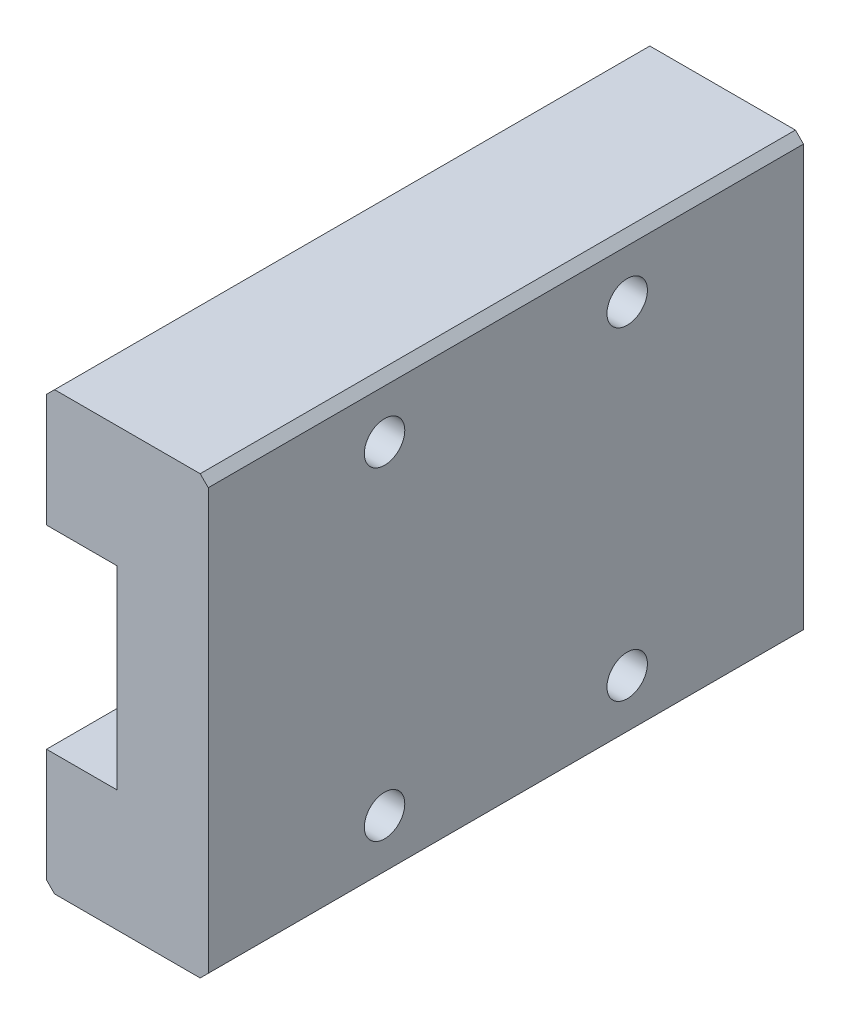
ISO-10303-21;
HEADER;
FILE_DESCRIPTION(('STEP AP214'),'2;1');
FILE_NAME('part.step','',(''),(''),'','','');
FILE_SCHEMA(('AUTOMOTIVE_DESIGN { 1 0 10303 214 1 1 1 1 }'));
ENDSEC;
DATA;
#1=APPLICATION_CONTEXT('core data for automotive mechanical design processes');
#2=APPLICATION_PROTOCOL_DEFINITION('international standard','automotive_design',2000,#1);
#3=PRODUCT_CONTEXT('',#1,'mechanical');
#4=PRODUCT('Part','Part','',(#3));
#5=PRODUCT_RELATED_PRODUCT_CATEGORY('part','',(#4));
#6=PRODUCT_DEFINITION_FORMATION('','',#4);
#7=PRODUCT_DEFINITION_CONTEXT('part definition',#1,'design');
#8=PRODUCT_DEFINITION('design','',#6,#7);
#9=PRODUCT_DEFINITION_SHAPE('','',#8);
#10=(LENGTH_UNIT() NAMED_UNIT(*) SI_UNIT(.MILLI.,.METRE.));
#11=(NAMED_UNIT(*) PLANE_ANGLE_UNIT() SI_UNIT($,.RADIAN.));
#12=(NAMED_UNIT(*) SI_UNIT($,.STERADIAN.) SOLID_ANGLE_UNIT());
#13=UNCERTAINTY_MEASURE_WITH_UNIT(LENGTH_MEASURE(1.E-05),#10,'distance_accuracy_value','');
#14=(GEOMETRIC_REPRESENTATION_CONTEXT(3) GLOBAL_UNCERTAINTY_ASSIGNED_CONTEXT((#13)) GLOBAL_UNIT_ASSIGNED_CONTEXT((#10,
#11,#12)) REPRESENTATION_CONTEXT('',''));
#15=CARTESIAN_POINT('',(0.,0.,0.));
#16=DIRECTION('',(0.,0.,1.));
#17=DIRECTION('',(1.,0.,0.));
#18=AXIS2_PLACEMENT_3D('',#15,#16,#17);
#19=CARTESIAN_POINT('',(0.500000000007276,0.,36.8));
#20=DIRECTION('',(0.,1.,0.));
#21=DIRECTION('',(0.,0.,1.));
#22=AXIS2_PLACEMENT_3D('',#19,#20,#21);
#23=PLANE('',#22);
#24=DIRECTION('',(1.,0.,0.));
#25=VECTOR('',#24,1.);
#26=CARTESIAN_POINT('',(0.500000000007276,0.,0.));
#27=LINE('',#26,#25);
#28=CARTESIAN_POINT('',(0.500000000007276,0.,0.));
#29=VERTEX_POINT('',#28);
#30=CARTESIAN_POINT('',(9.50000000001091,0.,0.));
#31=VERTEX_POINT('',#30);
#32=EDGE_CURVE('E154',#29,#31,#27,.T.);
#33=ORIENTED_EDGE('',*,*,#32,.T.);
#34=DIRECTION('',(0.,0.,-1.));
#35=VECTOR('',#34,1.);
#36=CARTESIAN_POINT('',(9.50000000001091,0.,36.8));
#37=LINE('',#36,#35);
#38=CARTESIAN_POINT('',(9.50000000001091,0.,36.8));
#39=VERTEX_POINT('',#38);
#40=EDGE_CURVE('E11',#39,#31,#37,.T.);
#41=ORIENTED_EDGE('',*,*,#40,.F.);
#42=DIRECTION('',(1.,0.,0.));
#43=VECTOR('',#42,1.);
#44=CARTESIAN_POINT('',(0.500000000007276,0.,36.8));
#45=LINE('',#44,#43);
#46=CARTESIAN_POINT('',(0.500000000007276,0.,36.8));
#47=VERTEX_POINT('',#46);
#48=EDGE_CURVE('E177',#47,#39,#45,.T.);
#49=ORIENTED_EDGE('',*,*,#48,.F.);
#50=DIRECTION('',(0.,0.,-1.));
#51=VECTOR('',#50,1.);
#52=CARTESIAN_POINT('',(0.500000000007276,0.,36.8));
#53=LINE('',#52,#51);
#54=EDGE_CURVE('E150',#47,#29,#53,.T.);
#55=ORIENTED_EDGE('',*,*,#54,.T.);
#56=EDGE_LOOP('',(#33,#41,#49,#55));
#57=FACE_BOUND('',#56,.T.);
#58=ADVANCED_FACE('F32',(#57),#23,.F.);
#59=CARTESIAN_POINT('',(10.0000000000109,0.499999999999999,36.8));
#60=DIRECTION('',(-0.707106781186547,0.707106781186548,0.));
#61=DIRECTION('',(-0.707106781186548,-0.707106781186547,0.));
#62=AXIS2_PLACEMENT_3D('',#59,#60,#61);
#63=PLANE('',#62);
#64=DIRECTION('',(0.707106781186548,0.707106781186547,0.));
#65=VECTOR('',#64,1.);
#66=CARTESIAN_POINT('',(10.0000000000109,0.499999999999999,0.));
#67=LINE('',#66,#65);
#68=CARTESIAN_POINT('',(10.0000000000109,0.499999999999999,0.));
#69=VERTEX_POINT('',#68);
#70=EDGE_CURVE('E157',#31,#69,#67,.T.);
#71=ORIENTED_EDGE('',*,*,#70,.T.);
#72=DIRECTION('',(0.,0.,-1.));
#73=VECTOR('',#72,1.);
#74=CARTESIAN_POINT('',(10.0000000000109,0.499999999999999,36.8));
#75=LINE('',#74,#73);
#76=CARTESIAN_POINT('',(10.0000000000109,0.499999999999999,36.8));
#77=VERTEX_POINT('',#76);
#78=EDGE_CURVE('E41',#77,#69,#75,.T.);
#79=ORIENTED_EDGE('',*,*,#78,.F.);
#80=DIRECTION('',(0.707106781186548,0.707106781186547,0.));
#81=VECTOR('',#80,1.);
#82=CARTESIAN_POINT('',(10.0000000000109,0.499999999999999,36.8));
#83=LINE('',#82,#81);
#84=EDGE_CURVE('E105',#39,#77,#83,.T.);
#85=ORIENTED_EDGE('',*,*,#84,.F.);
#86=ORIENTED_EDGE('',*,*,#40,.T.);
#87=EDGE_LOOP('',(#71,#79,#85,#86));
#88=FACE_BOUND('',#87,.T.);
#89=ADVANCED_FACE('F265',(#88),#63,.F.);
#90=CARTESIAN_POINT('',(10.0000000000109,26.5,36.8));
#91=DIRECTION('',(-1.,0.,0.));
#92=DIRECTION('',(0.,0.,1.));
#93=AXIS2_PLACEMENT_3D('',#90,#91,#92);
#94=PLANE('',#93);
#95=CARTESIAN_POINT('',(10.0000000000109,23.5,10.9000000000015));
#96=DIRECTION('',(1.,0.,0.));
#97=DIRECTION('',(0.,0.,-1.));
#98=AXIS2_PLACEMENT_3D('',#95,#96,#97);
#99=CIRCLE('',#98,1.25);
#100=CARTESIAN_POINT('',(10.0000000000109,23.5,9.65000000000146));
#101=VERTEX_POINT('',#100);
#102=EDGE_CURVE('E219',#101,#101,#99,.T.);
#103=ORIENTED_EDGE('',*,*,#102,.F.);
#104=EDGE_LOOP('',(#103));
#105=FACE_BOUND('',#104,.T.);
#106=CARTESIAN_POINT('',(10.0000000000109,3.5,10.9000000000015));
#107=DIRECTION('',(1.,0.,0.));
#108=DIRECTION('',(0.,0.,-1.));
#109=AXIS2_PLACEMENT_3D('',#106,#107,#108);
#110=CIRCLE('',#109,1.25);
#111=CARTESIAN_POINT('',(10.0000000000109,3.5,9.65000000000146));
#112=VERTEX_POINT('',#111);
#113=EDGE_CURVE('E209',#112,#112,#110,.T.);
#114=ORIENTED_EDGE('',*,*,#113,.F.);
#115=EDGE_LOOP('',(#114));
#116=FACE_BOUND('',#115,.T.);
#117=CARTESIAN_POINT('',(10.0000000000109,3.5,25.9000000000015));
#118=DIRECTION('',(1.,0.,0.));
#119=DIRECTION('',(0.,0.,-1.));
#120=AXIS2_PLACEMENT_3D('',#117,#118,#119);
#121=CIRCLE('',#120,1.25);
#122=CARTESIAN_POINT('',(10.0000000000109,3.5,24.6500000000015));
#123=VERTEX_POINT('',#122);
#124=EDGE_CURVE('E206',#123,#123,#121,.T.);
#125=ORIENTED_EDGE('',*,*,#124,.F.);
#126=EDGE_LOOP('',(#125));
#127=FACE_BOUND('',#126,.T.);
#128=CARTESIAN_POINT('',(10.0000000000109,23.5,25.9000000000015));
#129=DIRECTION('',(1.,0.,0.));
#130=DIRECTION('',(0.,0.,-1.));
#131=AXIS2_PLACEMENT_3D('',#128,#129,#130);
#132=CIRCLE('',#131,1.25);
#133=CARTESIAN_POINT('',(10.0000000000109,23.5,24.6500000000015));
#134=VERTEX_POINT('',#133);
#135=EDGE_CURVE('E203',#134,#134,#132,.T.);
#136=ORIENTED_EDGE('',*,*,#135,.F.);
#137=EDGE_LOOP('',(#136));
#138=FACE_BOUND('',#137,.T.);
#139=DIRECTION('',(0.,1.,0.));
#140=VECTOR('',#139,1.);
#141=CARTESIAN_POINT('',(10.0000000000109,26.5,0.));
#142=LINE('',#141,#140);
#143=CARTESIAN_POINT('',(10.0000000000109,26.5,0.));
#144=VERTEX_POINT('',#143);
#145=EDGE_CURVE('E160',#69,#144,#142,.T.);
#146=ORIENTED_EDGE('',*,*,#145,.T.);
#147=DIRECTION('',(0.,0.,-1.));
#148=VECTOR('',#147,1.);
#149=CARTESIAN_POINT('',(10.0000000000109,26.5,36.8));
#150=LINE('',#149,#148);
#151=CARTESIAN_POINT('',(10.0000000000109,26.5,36.8));
#152=VERTEX_POINT('',#151);
#153=EDGE_CURVE('E196',#152,#144,#150,.T.);
#154=ORIENTED_EDGE('',*,*,#153,.F.);
#155=DIRECTION('',(0.,1.,0.));
#156=VECTOR('',#155,1.);
#157=CARTESIAN_POINT('',(10.0000000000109,26.5,36.8));
#158=LINE('',#157,#156);
#159=EDGE_CURVE('E226',#77,#152,#158,.T.);
#160=ORIENTED_EDGE('',*,*,#159,.F.);
#161=ORIENTED_EDGE('',*,*,#78,.T.);
#162=EDGE_LOOP('',(#146,#154,#160,#161));
#163=FACE_BOUND('',#162,.T.);
#164=ADVANCED_FACE('F269',(#105,#116,#127,#138,#163),#94,.F.);
#165=CARTESIAN_POINT('',(10.0000000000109,26.5,36.8));
#166=DIRECTION('',(-0.707106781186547,-0.707106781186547,0.));
#167=DIRECTION('',(0.707106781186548,-0.707106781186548,0.));
#168=AXIS2_PLACEMENT_3D('',#165,#166,#167);
#169=PLANE('',#168);
#170=DIRECTION('',(-0.707106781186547,0.707106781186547,0.));
#171=VECTOR('',#170,1.);
#172=CARTESIAN_POINT('',(10.0000000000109,26.5,0.));
#173=LINE('',#172,#171);
#174=CARTESIAN_POINT('',(9.50000000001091,27.,0.));
#175=VERTEX_POINT('',#174);
#176=EDGE_CURVE('E162',#144,#175,#173,.T.);
#177=ORIENTED_EDGE('',*,*,#176,.T.);
#178=DIRECTION('',(0.,0.,-1.));
#179=VECTOR('',#178,1.);
#180=CARTESIAN_POINT('',(9.50000000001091,27.,36.8));
#181=LINE('',#180,#179);
#182=CARTESIAN_POINT('',(9.50000000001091,27.,36.8));
#183=VERTEX_POINT('',#182);
#184=EDGE_CURVE('E193',#183,#175,#181,.T.);
#185=ORIENTED_EDGE('',*,*,#184,.F.);
#186=DIRECTION('',(-0.707106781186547,0.707106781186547,0.));
#187=VECTOR('',#186,1.);
#188=CARTESIAN_POINT('',(10.0000000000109,26.5,36.8));
#189=LINE('',#188,#187);
#190=EDGE_CURVE('E228',#152,#183,#189,.T.);
#191=ORIENTED_EDGE('',*,*,#190,.F.);
#192=ORIENTED_EDGE('',*,*,#153,.T.);
#193=EDGE_LOOP('',(#177,#185,#191,#192));
#194=FACE_BOUND('',#193,.T.);
#195=ADVANCED_FACE('F273',(#194),#169,.F.);
#196=CARTESIAN_POINT('',(0.500000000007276,27.,36.8));
#197=DIRECTION('',(0.,-1.,0.));
#198=DIRECTION('',(0.,0.,-1.));
#199=AXIS2_PLACEMENT_3D('',#196,#197,#198);
#200=PLANE('',#199);
#201=DIRECTION('',(-1.,0.,0.));
#202=VECTOR('',#201,1.);
#203=CARTESIAN_POINT('',(0.500000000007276,27.,0.));
#204=LINE('',#203,#202);
#205=CARTESIAN_POINT('',(0.500000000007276,27.,0.));
#206=VERTEX_POINT('',#205);
#207=EDGE_CURVE('E164',#175,#206,#204,.T.);
#208=ORIENTED_EDGE('',*,*,#207,.T.);
#209=DIRECTION('',(0.,0.,-1.));
#210=VECTOR('',#209,1.);
#211=CARTESIAN_POINT('',(0.500000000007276,27.,36.8));
#212=LINE('',#211,#210);
#213=CARTESIAN_POINT('',(0.500000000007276,27.,36.8));
#214=VERTEX_POINT('',#213);
#215=EDGE_CURVE('E190',#214,#206,#212,.T.);
#216=ORIENTED_EDGE('',*,*,#215,.F.);
#217=DIRECTION('',(-1.,0.,0.));
#218=VECTOR('',#217,1.);
#219=CARTESIAN_POINT('',(0.500000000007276,27.,36.8));
#220=LINE('',#219,#218);
#221=EDGE_CURVE('E230',#183,#214,#220,.T.);
#222=ORIENTED_EDGE('',*,*,#221,.F.);
#223=ORIENTED_EDGE('',*,*,#184,.T.);
#224=EDGE_LOOP('',(#208,#216,#222,#223));
#225=FACE_BOUND('',#224,.T.);
#226=ADVANCED_FACE('F279',(#225),#200,.F.);
#227=CARTESIAN_POINT('',(7.27557429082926E-12,26.5,36.8));
#228=DIRECTION('',(0.707106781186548,-0.707106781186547,0.));
#229=DIRECTION('',(0.707106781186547,0.707106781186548,0.));
#230=AXIS2_PLACEMENT_3D('',#227,#228,#229);
#231=PLANE('',#230);
#232=DIRECTION('',(-0.707106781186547,-0.707106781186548,0.));
#233=VECTOR('',#232,1.);
#234=CARTESIAN_POINT('',(7.27557429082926E-12,26.5,0.));
#235=LINE('',#234,#233);
#236=CARTESIAN_POINT('',(7.27557429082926E-12,26.5,0.));
#237=VERTEX_POINT('',#236);
#238=EDGE_CURVE('E166',#206,#237,#235,.T.);
#239=ORIENTED_EDGE('',*,*,#238,.T.);
#240=DIRECTION('',(0.,0.,-1.));
#241=VECTOR('',#240,1.);
#242=CARTESIAN_POINT('',(7.27557429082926E-12,26.5,36.8));
#243=LINE('',#242,#241);
#244=CARTESIAN_POINT('',(7.27557429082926E-12,26.5,36.8));
#245=VERTEX_POINT('',#244);
#246=EDGE_CURVE('E187',#245,#237,#243,.T.);
#247=ORIENTED_EDGE('',*,*,#246,.F.);
#248=DIRECTION('',(-0.707106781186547,-0.707106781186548,0.));
#249=VECTOR('',#248,1.);
#250=CARTESIAN_POINT('',(7.27557429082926E-12,26.5,36.8));
#251=LINE('',#250,#249);
#252=EDGE_CURVE('E232',#214,#245,#251,.T.);
#253=ORIENTED_EDGE('',*,*,#252,.F.);
#254=ORIENTED_EDGE('',*,*,#215,.T.);
#255=EDGE_LOOP('',(#239,#247,#253,#254));
#256=FACE_BOUND('',#255,.T.);
#257=ADVANCED_FACE('F283',(#256),#231,.F.);
#258=CARTESIAN_POINT('',(7.27557429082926E-12,26.5,36.8));
#259=DIRECTION('',(1.,0.,0.));
#260=DIRECTION('',(0.,1.,0.));
#261=AXIS2_PLACEMENT_3D('',#258,#259,#260);
#262=PLANE('',#261);
#263=CARTESIAN_POINT('',(7.27543025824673E-12,23.5,10.9000000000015));
#264=DIRECTION('',(1.,0.,0.));
#265=DIRECTION('',(0.,1.,0.));
#266=AXIS2_PLACEMENT_3D('',#263,#264,#265);
#267=CIRCLE('',#266,1.25);
#268=CARTESIAN_POINT('',(7.27536180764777E-12,24.75,10.9000000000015));
#269=VERTEX_POINT('',#268);
#270=EDGE_CURVE('E35',#269,#269,#267,.T.);
#271=ORIENTED_EDGE('',*,*,#270,.T.);
#272=EDGE_LOOP('',(#271));
#273=FACE_BOUND('',#272,.T.);
#274=CARTESIAN_POINT('',(7.27543025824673E-12,23.5,25.9000000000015));
#275=DIRECTION('',(1.,0.,0.));
#276=DIRECTION('',(0.,1.,0.));
#277=AXIS2_PLACEMENT_3D('',#274,#275,#276);
#278=CIRCLE('',#277,1.25);
#279=CARTESIAN_POINT('',(7.27536180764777E-12,24.75,25.9000000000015));
#280=VERTEX_POINT('',#279);
#281=EDGE_CURVE('E158',#280,#280,#278,.T.);
#282=ORIENTED_EDGE('',*,*,#281,.T.);
#283=EDGE_LOOP('',(#282));
#284=FACE_BOUND('',#283,.T.);
#285=DIRECTION('',(0.,-1.,0.));
#286=VECTOR('',#285,1.);
#287=CARTESIAN_POINT('',(7.27557429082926E-12,26.5,0.));
#288=LINE('',#287,#286);
#289=CARTESIAN_POINT('',(7.27595761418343E-12,19.5,0.));
#290=VERTEX_POINT('',#289);
#291=EDGE_CURVE('E168',#237,#290,#288,.T.);
#292=ORIENTED_EDGE('',*,*,#291,.T.);
#293=DIRECTION('',(0.,0.,-1.));
#294=VECTOR('',#293,1.);
#295=CARTESIAN_POINT('',(7.27595761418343E-12,19.5,36.8));
#296=LINE('',#295,#294);
#297=CARTESIAN_POINT('',(7.27595761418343E-12,19.5,36.8));
#298=VERTEX_POINT('',#297);
#299=EDGE_CURVE('E184',#298,#290,#296,.T.);
#300=ORIENTED_EDGE('',*,*,#299,.F.);
#301=DIRECTION('',(0.,-1.,0.));
#302=VECTOR('',#301,1.);
#303=CARTESIAN_POINT('',(7.27557429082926E-12,26.5,36.8));
#304=LINE('',#303,#302);
#305=EDGE_CURVE('E234',#245,#298,#304,.T.);
#306=ORIENTED_EDGE('',*,*,#305,.F.);
#307=ORIENTED_EDGE('',*,*,#246,.T.);
#308=EDGE_LOOP('',(#292,#300,#306,#307));
#309=FACE_BOUND('',#308,.T.);
#310=ADVANCED_FACE('F287',(#273,#284,#309),#262,.F.);
#311=CARTESIAN_POINT('',(7.27595761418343E-12,19.5,36.8));
#312=DIRECTION('',(0.,1.,0.));
#313=DIRECTION('',(0.,0.,1.));
#314=AXIS2_PLACEMENT_3D('',#311,#312,#313);
#315=PLANE('',#314);
#316=DIRECTION('',(1.,0.,0.));
#317=VECTOR('',#316,1.);
#318=CARTESIAN_POINT('',(7.27595761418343E-12,19.5,0.));
#319=LINE('',#318,#317);
#320=CARTESIAN_POINT('',(4.35000000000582,19.5,0.));
#321=VERTEX_POINT('',#320);
#322=EDGE_CURVE('E170',#290,#321,#319,.T.);
#323=ORIENTED_EDGE('',*,*,#322,.T.);
#324=DIRECTION('',(0.,0.,-1.));
#325=VECTOR('',#324,1.);
#326=CARTESIAN_POINT('',(4.35000000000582,19.5,36.8));
#327=LINE('',#326,#325);
#328=CARTESIAN_POINT('',(4.35000000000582,19.5,36.8));
#329=VERTEX_POINT('',#328);
#330=EDGE_CURVE('E181',#329,#321,#327,.T.);
#331=ORIENTED_EDGE('',*,*,#330,.F.);
#332=DIRECTION('',(1.,0.,0.));
#333=VECTOR('',#332,1.);
#334=CARTESIAN_POINT('',(7.27595761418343E-12,19.5,36.8));
#335=LINE('',#334,#333);
#336=EDGE_CURVE('E236',#298,#329,#335,.T.);
#337=ORIENTED_EDGE('',*,*,#336,.F.);
#338=ORIENTED_EDGE('',*,*,#299,.T.);
#339=EDGE_LOOP('',(#323,#331,#337,#338));
#340=FACE_BOUND('',#339,.T.);
#341=ADVANCED_FACE('F242',(#340),#315,.F.);
#342=CARTESIAN_POINT('',(4.35000000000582,19.5,36.8));
#343=DIRECTION('',(1.,0.,0.));
#344=DIRECTION('',(0.,0.,-1.));
#345=AXIS2_PLACEMENT_3D('',#342,#343,#344);
#346=PLANE('',#345);
#347=DIRECTION('',(0.,-1.,0.));
#348=VECTOR('',#347,1.);
#349=CARTESIAN_POINT('',(4.35000000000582,19.5,0.));
#350=LINE('',#349,#348);
#351=CARTESIAN_POINT('',(4.35000000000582,7.5,0.));
#352=VERTEX_POINT('',#351);
#353=EDGE_CURVE('E172',#321,#352,#350,.T.);
#354=ORIENTED_EDGE('',*,*,#353,.T.);
#355=DIRECTION('',(0.,0.,-1.));
#356=VECTOR('',#355,1.);
#357=CARTESIAN_POINT('',(4.35000000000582,7.5,36.8));
#358=LINE('',#357,#356);
#359=CARTESIAN_POINT('',(4.35000000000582,7.5,36.8));
#360=VERTEX_POINT('',#359);
#361=EDGE_CURVE('E145',#360,#352,#358,.T.);
#362=ORIENTED_EDGE('',*,*,#361,.F.);
#363=DIRECTION('',(0.,-1.,0.));
#364=VECTOR('',#363,1.);
#365=CARTESIAN_POINT('',(4.35000000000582,19.5,36.8));
#366=LINE('',#365,#364);
#367=EDGE_CURVE('E136',#329,#360,#366,.T.);
#368=ORIENTED_EDGE('',*,*,#367,.F.);
#369=ORIENTED_EDGE('',*,*,#330,.T.);
#370=EDGE_LOOP('',(#354,#362,#368,#369));
#371=FACE_BOUND('',#370,.T.);
#372=ADVANCED_FACE('F246',(#371),#346,.F.);
#373=CARTESIAN_POINT('',(7.27595761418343E-12,7.5,36.8));
#374=DIRECTION('',(0.,-1.,0.));
#375=DIRECTION('',(0.,0.,-1.));
#376=AXIS2_PLACEMENT_3D('',#373,#374,#375);
#377=PLANE('',#376);
#378=DIRECTION('',(-1.,0.,0.));
#379=VECTOR('',#378,1.);
#380=CARTESIAN_POINT('',(7.27595761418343E-12,7.5,0.));
#381=LINE('',#380,#379);
#382=CARTESIAN_POINT('',(7.27595761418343E-12,7.5,0.));
#383=VERTEX_POINT('',#382);
#384=EDGE_CURVE('E144',#352,#383,#381,.T.);
#385=ORIENTED_EDGE('',*,*,#384,.T.);
#386=DIRECTION('',(0.,0.,-1.));
#387=VECTOR('',#386,1.);
#388=CARTESIAN_POINT('',(7.27595761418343E-12,7.5,36.8));
#389=LINE('',#388,#387);
#390=CARTESIAN_POINT('',(7.27595761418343E-12,7.5,36.8));
#391=VERTEX_POINT('',#390);
#392=EDGE_CURVE('E141',#391,#383,#389,.T.);
#393=ORIENTED_EDGE('',*,*,#392,.F.);
#394=DIRECTION('',(-1.,0.,0.));
#395=VECTOR('',#394,1.);
#396=CARTESIAN_POINT('',(7.27595761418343E-12,7.5,36.8));
#397=LINE('',#396,#395);
#398=EDGE_CURVE('E130',#360,#391,#397,.T.);
#399=ORIENTED_EDGE('',*,*,#398,.F.);
#400=ORIENTED_EDGE('',*,*,#361,.T.);
#401=EDGE_LOOP('',(#385,#393,#399,#400));
#402=FACE_BOUND('',#401,.T.);
#403=ADVANCED_FACE('F142',(#402),#377,.F.);
#404=CARTESIAN_POINT('',(7.27595761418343E-12,7.5,36.8));
#405=DIRECTION('',(1.,0.,0.));
#406=DIRECTION('',(0.,0.,-1.));
#407=AXIS2_PLACEMENT_3D('',#404,#405,#406);
#408=PLANE('',#407);
#409=CARTESIAN_POINT('',(7.27586393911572E-12,3.5,10.9000000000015));
#410=DIRECTION('',(1.,0.,0.));
#411=DIRECTION('',(0.,0.,-1.));
#412=AXIS2_PLACEMENT_3D('',#409,#410,#411);
#413=CIRCLE('',#412,1.25);
#414=CARTESIAN_POINT('',(7.27586393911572E-12,3.5,9.65000000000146));
#415=VERTEX_POINT('',#414);
#416=EDGE_CURVE('E207',#415,#415,#413,.T.);
#417=ORIENTED_EDGE('',*,*,#416,.T.);
#418=EDGE_LOOP('',(#417));
#419=FACE_BOUND('',#418,.T.);
#420=CARTESIAN_POINT('',(7.27586393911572E-12,3.5,25.9000000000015));
#421=DIRECTION('',(1.,0.,0.));
#422=DIRECTION('',(0.,0.,-1.));
#423=AXIS2_PLACEMENT_3D('',#420,#421,#422);
#424=CIRCLE('',#423,1.25);
#425=CARTESIAN_POINT('',(7.27586393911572E-12,3.5,24.6500000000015));
#426=VERTEX_POINT('',#425);
#427=EDGE_CURVE('E204',#426,#426,#424,.T.);
#428=ORIENTED_EDGE('',*,*,#427,.T.);
#429=EDGE_LOOP('',(#428));
#430=FACE_BOUND('',#429,.T.);
#431=DIRECTION('',(0.,-1.,0.));
#432=VECTOR('',#431,1.);
#433=CARTESIAN_POINT('',(7.27595761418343E-12,7.5,0.));
#434=LINE('',#433,#432);
#435=CARTESIAN_POINT('',(7.27595761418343E-12,0.5,0.));
#436=VERTEX_POINT('',#435);
#437=EDGE_CURVE('E91',#383,#436,#434,.T.);
#438=ORIENTED_EDGE('',*,*,#437,.T.);
#439=DIRECTION('',(0.,0.,-1.));
#440=VECTOR('',#439,1.);
#441=CARTESIAN_POINT('',(7.27595761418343E-12,0.5,36.8));
#442=LINE('',#441,#440);
#443=CARTESIAN_POINT('',(7.27595761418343E-12,0.5,36.8));
#444=VERTEX_POINT('',#443);
#445=EDGE_CURVE('E146',#444,#436,#442,.T.);
#446=ORIENTED_EDGE('',*,*,#445,.F.);
#447=DIRECTION('',(0.,-1.,0.));
#448=VECTOR('',#447,1.);
#449=CARTESIAN_POINT('',(7.27595761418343E-12,7.5,36.8));
#450=LINE('',#449,#448);
#451=EDGE_CURVE('E134',#391,#444,#450,.T.);
#452=ORIENTED_EDGE('',*,*,#451,.F.);
#453=ORIENTED_EDGE('',*,*,#392,.T.);
#454=EDGE_LOOP('',(#438,#446,#452,#453));
#455=FACE_BOUND('',#454,.T.);
#456=ADVANCED_FACE('F148',(#419,#430,#455),#408,.F.);
#457=CARTESIAN_POINT('',(0.500000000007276,0.,36.8));
#458=DIRECTION('',(0.707106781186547,0.707106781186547,0.));
#459=DIRECTION('',(-0.707106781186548,0.707106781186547,0.));
#460=AXIS2_PLACEMENT_3D('',#457,#458,#459);
#461=PLANE('',#460);
#462=DIRECTION('',(0.707106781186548,-0.707106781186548,0.));
#463=VECTOR('',#462,1.);
#464=CARTESIAN_POINT('',(0.500000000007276,0.,0.));
#465=LINE('',#464,#463);
#466=EDGE_CURVE('E97',#436,#29,#465,.T.);
#467=ORIENTED_EDGE('',*,*,#466,.T.);
#468=ORIENTED_EDGE('',*,*,#54,.F.);
#469=DIRECTION('',(0.707106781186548,-0.707106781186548,0.));
#470=VECTOR('',#469,1.);
#471=CARTESIAN_POINT('',(0.500000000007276,0.,36.8));
#472=LINE('',#471,#470);
#473=EDGE_CURVE('E50',#444,#47,#472,.T.);
#474=ORIENTED_EDGE('',*,*,#473,.F.);
#475=ORIENTED_EDGE('',*,*,#445,.T.);
#476=EDGE_LOOP('',(#467,#468,#474,#475));
#477=FACE_BOUND('',#476,.T.);
#478=ADVANCED_FACE('F254',(#477),#461,.F.);
#479=CARTESIAN_POINT('',(10.0000000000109,0.,36.8));
#480=DIRECTION('',(0.,0.,-1.));
#481=DIRECTION('',(-1.,0.,0.));
#482=AXIS2_PLACEMENT_3D('',#479,#480,#481);
#483=PLANE('',#482);
#484=ORIENTED_EDGE('',*,*,#48,.T.);
#485=ORIENTED_EDGE('',*,*,#84,.T.);
#486=ORIENTED_EDGE('',*,*,#159,.T.);
#487=ORIENTED_EDGE('',*,*,#190,.T.);
#488=ORIENTED_EDGE('',*,*,#221,.T.);
#489=ORIENTED_EDGE('',*,*,#252,.T.);
#490=ORIENTED_EDGE('',*,*,#305,.T.);
#491=ORIENTED_EDGE('',*,*,#336,.T.);
#492=ORIENTED_EDGE('',*,*,#367,.T.);
#493=ORIENTED_EDGE('',*,*,#398,.T.);
#494=ORIENTED_EDGE('',*,*,#451,.T.);
#495=ORIENTED_EDGE('',*,*,#473,.T.);
#496=EDGE_LOOP('',(#484,#485,#486,#487,#488,#489,#490,#491,#492,#493,#494,#495));
#497=FACE_BOUND('',#496,.T.);
#498=ADVANCED_FACE('F132',(#497),#483,.F.);
#499=CARTESIAN_POINT('',(10.0000000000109,0.,0.));
#500=DIRECTION('',(0.,0.,-1.));
#501=DIRECTION('',(-1.,0.,0.));
#502=AXIS2_PLACEMENT_3D('',#499,#500,#501);
#503=PLANE('',#502);
#504=ORIENTED_EDGE('',*,*,#32,.F.);
#505=ORIENTED_EDGE('',*,*,#466,.F.);
#506=ORIENTED_EDGE('',*,*,#437,.F.);
#507=ORIENTED_EDGE('',*,*,#384,.F.);
#508=ORIENTED_EDGE('',*,*,#353,.F.);
#509=ORIENTED_EDGE('',*,*,#322,.F.);
#510=ORIENTED_EDGE('',*,*,#291,.F.);
#511=ORIENTED_EDGE('',*,*,#238,.F.);
#512=ORIENTED_EDGE('',*,*,#207,.F.);
#513=ORIENTED_EDGE('',*,*,#176,.F.);
#514=ORIENTED_EDGE('',*,*,#145,.F.);
#515=ORIENTED_EDGE('',*,*,#70,.F.);
#516=EDGE_LOOP('',(#504,#505,#506,#507,#508,#509,#510,#511,#512,#513,#514,#515));
#517=FACE_BOUND('',#516,.T.);
#518=ADVANCED_FACE('F249',(#517),#503,.T.);
#519=CARTESIAN_POINT('',(-1.99999999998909,23.5,25.9000000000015));
#520=DIRECTION('',(1.,0.,0.));
#521=DIRECTION('',(0.,0.,-1.));
#522=AXIS2_PLACEMENT_3D('',#519,#520,#521);
#523=CYLINDRICAL_SURFACE('',#522,1.25);
#524=ORIENTED_EDGE('',*,*,#135,.T.);
#525=EDGE_LOOP('',(#524));
#526=FACE_BOUND('',#525,.T.);
#527=ORIENTED_EDGE('',*,*,#281,.F.);
#528=EDGE_LOOP('',(#527));
#529=FACE_BOUND('',#528,.T.);
#530=ADVANCED_FACE('F315',(#526,#529),#523,.F.);
#531=CARTESIAN_POINT('',(-1.99999999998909,3.5,25.9000000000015));
#532=DIRECTION('',(1.,0.,0.));
#533=DIRECTION('',(0.,0.,-1.));
#534=AXIS2_PLACEMENT_3D('',#531,#532,#533);
#535=CYLINDRICAL_SURFACE('',#534,1.25);
#536=ORIENTED_EDGE('',*,*,#124,.T.);
#537=EDGE_LOOP('',(#536));
#538=FACE_BOUND('',#537,.T.);
#539=ORIENTED_EDGE('',*,*,#427,.F.);
#540=EDGE_LOOP('',(#539));
#541=FACE_BOUND('',#540,.T.);
#542=ADVANCED_FACE('F320',(#538,#541),#535,.F.);
#543=CARTESIAN_POINT('',(-1.99999999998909,3.5,10.9000000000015));
#544=DIRECTION('',(1.,0.,0.));
#545=DIRECTION('',(0.,0.,-1.));
#546=AXIS2_PLACEMENT_3D('',#543,#544,#545);
#547=CYLINDRICAL_SURFACE('',#546,1.25);
#548=ORIENTED_EDGE('',*,*,#113,.T.);
#549=EDGE_LOOP('',(#548));
#550=FACE_BOUND('',#549,.T.);
#551=ORIENTED_EDGE('',*,*,#416,.F.);
#552=EDGE_LOOP('',(#551));
#553=FACE_BOUND('',#552,.T.);
#554=ADVANCED_FACE('F332',(#550,#553),#547,.F.);
#555=CARTESIAN_POINT('',(-1.99999999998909,23.5,10.9000000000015));
#556=DIRECTION('',(1.,0.,0.));
#557=DIRECTION('',(0.,0.,-1.));
#558=AXIS2_PLACEMENT_3D('',#555,#556,#557);
#559=CYLINDRICAL_SURFACE('',#558,1.25);
#560=ORIENTED_EDGE('',*,*,#102,.T.);
#561=EDGE_LOOP('',(#560));
#562=FACE_BOUND('',#561,.T.);
#563=ORIENTED_EDGE('',*,*,#270,.F.);
#564=EDGE_LOOP('',(#563));
#565=FACE_BOUND('',#564,.T.);
#566=ADVANCED_FACE('F342',(#562,#565),#559,.F.);
#567=CLOSED_SHELL('',(#58,#89,#164,#195,#226,#257,#310,#341,#372,#403,#456,#478,#498,#518,#530,
#542,#554,#566));
#568=MANIFOLD_SOLID_BREP('B2',#567);
#569=ADVANCED_BREP_SHAPE_REPRESENTATION('',(#18,#568),#14);
#570=SHAPE_DEFINITION_REPRESENTATION(#9,#569);
ENDSEC;
END-ISO-10303-21;
